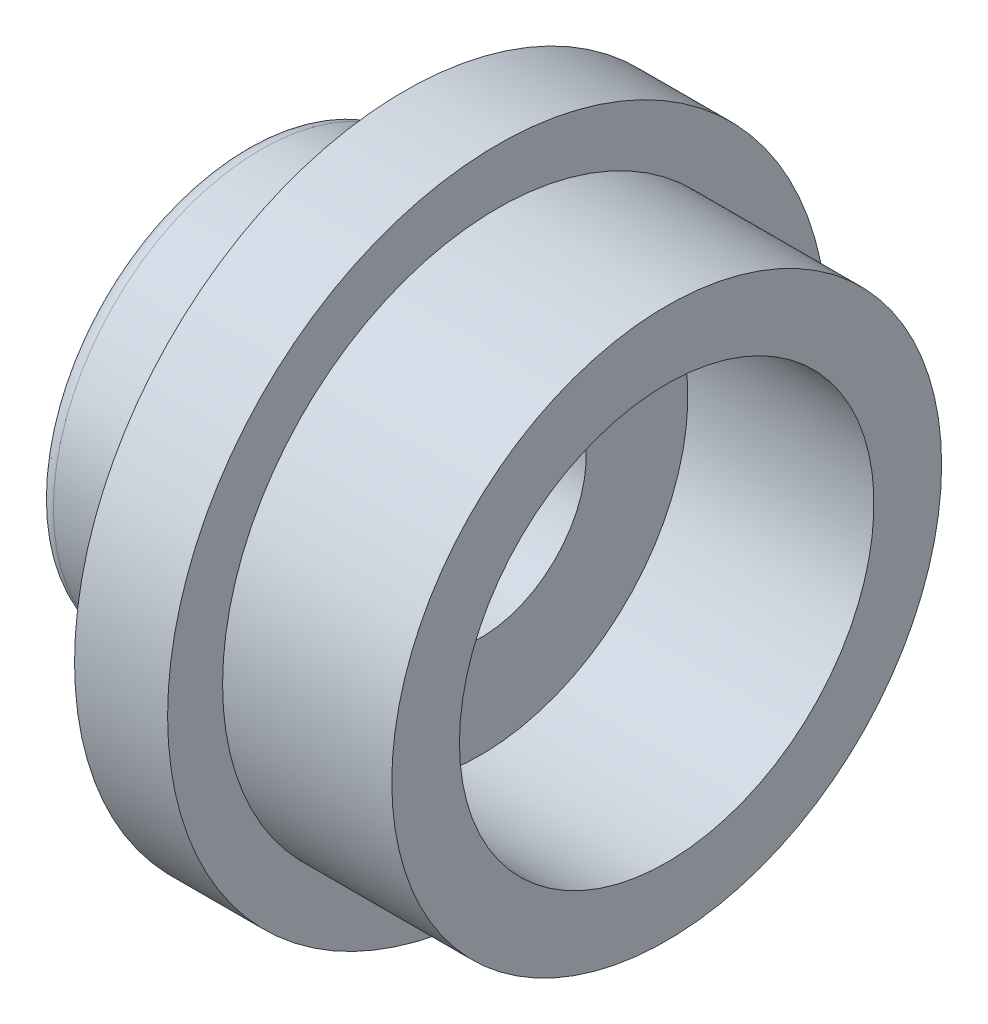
ISO-10303-21;
HEADER;
FILE_DESCRIPTION(('STEP AP214'),'2;1');
FILE_NAME('part.step','',(''),(''),'','','');
FILE_SCHEMA(('AUTOMOTIVE_DESIGN { 1 0 10303 214 1 1 1 1 }'));
ENDSEC;
DATA;
#1=APPLICATION_CONTEXT('core data for automotive mechanical design processes');
#2=APPLICATION_PROTOCOL_DEFINITION('international standard','automotive_design',2000,#1);
#3=PRODUCT_CONTEXT('',#1,'mechanical');
#4=PRODUCT('Part','Part','',(#3));
#5=PRODUCT_RELATED_PRODUCT_CATEGORY('part','',(#4));
#6=PRODUCT_DEFINITION_FORMATION('','',#4);
#7=PRODUCT_DEFINITION_CONTEXT('part definition',#1,'design');
#8=PRODUCT_DEFINITION('design','',#6,#7);
#9=PRODUCT_DEFINITION_SHAPE('','',#8);
#10=(LENGTH_UNIT() NAMED_UNIT(*) SI_UNIT(.MILLI.,.METRE.));
#11=(NAMED_UNIT(*) PLANE_ANGLE_UNIT() SI_UNIT($,.RADIAN.));
#12=(NAMED_UNIT(*) SI_UNIT($,.STERADIAN.) SOLID_ANGLE_UNIT());
#13=UNCERTAINTY_MEASURE_WITH_UNIT(LENGTH_MEASURE(1.E-05),#10,'distance_accuracy_value','');
#14=(GEOMETRIC_REPRESENTATION_CONTEXT(3) GLOBAL_UNCERTAINTY_ASSIGNED_CONTEXT((#13)) GLOBAL_UNIT_ASSIGNED_CONTEXT((#10,
#11,#12)) REPRESENTATION_CONTEXT('',''));
#15=CARTESIAN_POINT('',(0.,0.,0.));
#16=DIRECTION('',(0.,0.,1.));
#17=DIRECTION('',(1.,0.,0.));
#18=AXIS2_PLACEMENT_3D('',#15,#16,#17);
#19=CARTESIAN_POINT('',(0.,0.,0.));
#20=DIRECTION('',(-1.,0.,0.));
#21=DIRECTION('',(0.,0.,1.));
#22=AXIS2_PLACEMENT_3D('',#19,#20,#21);
#23=CYLINDRICAL_SURFACE('',#22,3.25);
#24=CARTESIAN_POINT('',(3.,0.,0.));
#25=DIRECTION('',(-1.,0.,0.));
#26=DIRECTION('',(0.,0.,1.));
#27=AXIS2_PLACEMENT_3D('',#24,#25,#26);
#28=CIRCLE('',#27,3.25);
#29=CARTESIAN_POINT('',(3.,0.,3.25));
#30=VERTEX_POINT('',#29);
#31=EDGE_CURVE('E34',#30,#30,#28,.T.);
#32=ORIENTED_EDGE('',*,*,#31,.F.);
#33=EDGE_LOOP('',(#32));
#34=FACE_BOUND('',#33,.T.);
#35=CARTESIAN_POINT('',(5.,0.,0.));
#36=DIRECTION('',(-1.,0.,0.));
#37=DIRECTION('',(0.,0.,1.));
#38=AXIS2_PLACEMENT_3D('',#35,#36,#37);
#39=CIRCLE('',#38,3.25);
#40=CARTESIAN_POINT('',(5.,0.,3.25));
#41=VERTEX_POINT('',#40);
#42=EDGE_CURVE('E61',#41,#41,#39,.T.);
#43=ORIENTED_EDGE('',*,*,#42,.T.);
#44=EDGE_LOOP('',(#43));
#45=FACE_BOUND('',#44,.T.);
#46=ADVANCED_FACE('F24',(#34,#45),#23,.T.);
#47=CARTESIAN_POINT('',(3.,3.25,0.));
#48=DIRECTION('',(-1.,0.,0.));
#49=DIRECTION('',(0.,0.,1.));
#50=AXIS2_PLACEMENT_3D('',#47,#48,#49);
#51=PLANE('',#50);
#52=CARTESIAN_POINT('',(3.,0.,0.));
#53=DIRECTION('',(-1.,0.,0.));
#54=DIRECTION('',(0.,0.,1.));
#55=AXIS2_PLACEMENT_3D('',#52,#53,#54);
#56=CIRCLE('',#55,3.9);
#57=CARTESIAN_POINT('',(3.,0.,3.9));
#58=VERTEX_POINT('',#57);
#59=EDGE_CURVE('E38',#58,#58,#56,.T.);
#60=ORIENTED_EDGE('',*,*,#59,.F.);
#61=EDGE_LOOP('',(#60));
#62=FACE_BOUND('',#61,.T.);
#63=ORIENTED_EDGE('',*,*,#31,.T.);
#64=EDGE_LOOP('',(#63));
#65=FACE_BOUND('',#64,.T.);
#66=ADVANCED_FACE('F102',(#62,#65),#51,.F.);
#67=CARTESIAN_POINT('',(0.,0.,0.));
#68=DIRECTION('',(-1.,0.,0.));
#69=DIRECTION('',(0.,0.,1.));
#70=AXIS2_PLACEMENT_3D('',#67,#68,#69);
#71=CYLINDRICAL_SURFACE('',#70,3.9);
#72=CARTESIAN_POINT('',(1.9,0.,0.));
#73=DIRECTION('',(-1.,0.,0.));
#74=DIRECTION('',(0.,0.,1.));
#75=AXIS2_PLACEMENT_3D('',#72,#73,#74);
#76=CIRCLE('',#75,3.9);
#77=CARTESIAN_POINT('',(1.9,0.,3.9));
#78=VERTEX_POINT('',#77);
#79=EDGE_CURVE('E43',#78,#78,#76,.T.);
#80=ORIENTED_EDGE('',*,*,#79,.F.);
#81=EDGE_LOOP('',(#80));
#82=FACE_BOUND('',#81,.T.);
#83=ORIENTED_EDGE('',*,*,#59,.T.);
#84=EDGE_LOOP('',(#83));
#85=FACE_BOUND('',#84,.T.);
#86=ADVANCED_FACE('F107',(#82,#85),#71,.T.);
#87=CARTESIAN_POINT('',(1.9,3.9,0.));
#88=DIRECTION('',(1.,0.,0.));
#89=DIRECTION('',(0.,0.,-1.));
#90=AXIS2_PLACEMENT_3D('',#87,#88,#89);
#91=PLANE('',#90);
#92=CARTESIAN_POINT('',(1.9,0.,0.));
#93=DIRECTION('',(-1.,0.,0.));
#94=DIRECTION('',(0.,0.,1.));
#95=AXIS2_PLACEMENT_3D('',#92,#93,#94);
#96=CIRCLE('',#95,2.45);
#97=CARTESIAN_POINT('',(1.9,0.,2.45));
#98=VERTEX_POINT('',#97);
#99=EDGE_CURVE('E46',#98,#98,#96,.T.);
#100=ORIENTED_EDGE('',*,*,#99,.F.);
#101=EDGE_LOOP('',(#100));
#102=FACE_BOUND('',#101,.T.);
#103=ORIENTED_EDGE('',*,*,#79,.T.);
#104=EDGE_LOOP('',(#103));
#105=FACE_BOUND('',#104,.T.);
#106=ADVANCED_FACE('F114',(#102,#105),#91,.F.);
#107=CARTESIAN_POINT('',(0.,0.,0.));
#108=DIRECTION('',(-1.,0.,0.));
#109=DIRECTION('',(0.,0.,1.));
#110=AXIS2_PLACEMENT_3D('',#107,#108,#109);
#111=CYLINDRICAL_SURFACE('',#110,2.45);
#112=CARTESIAN_POINT('',(0.200000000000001,0.,0.));
#113=DIRECTION('',(1.,0.,0.));
#114=DIRECTION('',(0.,0.,-1.));
#115=AXIS2_PLACEMENT_3D('',#112,#113,#114);
#116=CIRCLE('',#115,2.45);
#117=CARTESIAN_POINT('',(0.200000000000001,0.,-2.45));
#118=VERTEX_POINT('',#117);
#119=EDGE_CURVE('E10',#118,#118,#116,.T.);
#120=ORIENTED_EDGE('',*,*,#119,.T.);
#121=EDGE_LOOP('',(#120));
#122=FACE_BOUND('',#121,.T.);
#123=ORIENTED_EDGE('',*,*,#99,.T.);
#124=EDGE_LOOP('',(#123));
#125=FACE_BOUND('',#124,.T.);
#126=ADVANCED_FACE('F99',(#122,#125),#111,.T.);
#127=CARTESIAN_POINT('',(0.,2.45,0.));
#128=DIRECTION('',(1.,0.,0.));
#129=DIRECTION('',(0.,0.,-1.));
#130=AXIS2_PLACEMENT_3D('',#127,#128,#129);
#131=PLANE('',#130);
#132=CARTESIAN_POINT('',(0.,0.,0.));
#133=DIRECTION('',(1.,0.,0.));
#134=DIRECTION('',(0.,0.,-1.));
#135=AXIS2_PLACEMENT_3D('',#132,#133,#134);
#136=CIRCLE('',#135,2.25);
#137=CARTESIAN_POINT('',(0.,0.,-2.25));
#138=VERTEX_POINT('',#137);
#139=EDGE_CURVE('E30',#138,#138,#136,.F.);
#140=ORIENTED_EDGE('',*,*,#139,.T.);
#141=EDGE_LOOP('',(#140));
#142=FACE_BOUND('',#141,.T.);
#143=ADVANCED_FACE('F93',(#142),#131,.F.);
#144=CARTESIAN_POINT('',(1.2,1.25,0.));
#145=DIRECTION('',(-1.,0.,0.));
#146=DIRECTION('',(0.,0.,1.));
#147=AXIS2_PLACEMENT_3D('',#144,#145,#146);
#148=PLANE('',#147);
#149=CARTESIAN_POINT('',(1.2,0.,0.));
#150=DIRECTION('',(-1.,0.,0.));
#151=DIRECTION('',(0.,0.,1.));
#152=AXIS2_PLACEMENT_3D('',#149,#150,#151);
#153=CIRCLE('',#152,1.25);
#154=CARTESIAN_POINT('',(1.2,0.,1.25));
#155=VERTEX_POINT('',#154);
#156=EDGE_CURVE('E49',#155,#155,#153,.T.);
#157=ORIENTED_EDGE('',*,*,#156,.F.);
#158=EDGE_LOOP('',(#157));
#159=FACE_BOUND('',#158,.T.);
#160=ADVANCED_FACE('F88',(#159),#148,.F.);
#161=CARTESIAN_POINT('',(0.,0.,0.));
#162=DIRECTION('',(-1.,0.,0.));
#163=DIRECTION('',(0.,0.,1.));
#164=AXIS2_PLACEMENT_3D('',#161,#162,#163);
#165=CYLINDRICAL_SURFACE('',#164,1.25);
#166=CARTESIAN_POINT('',(2.8,0.,0.));
#167=DIRECTION('',(-1.,0.,0.));
#168=DIRECTION('',(0.,0.,1.));
#169=AXIS2_PLACEMENT_3D('',#166,#167,#168);
#170=CIRCLE('',#169,1.25);
#171=CARTESIAN_POINT('',(2.8,0.,1.25));
#172=VERTEX_POINT('',#171);
#173=EDGE_CURVE('E52',#172,#172,#170,.T.);
#174=ORIENTED_EDGE('',*,*,#173,.F.);
#175=EDGE_LOOP('',(#174));
#176=FACE_BOUND('',#175,.T.);
#177=ORIENTED_EDGE('',*,*,#156,.T.);
#178=EDGE_LOOP('',(#177));
#179=FACE_BOUND('',#178,.T.);
#180=ADVANCED_FACE('F82',(#176,#179),#165,.F.);
#181=CARTESIAN_POINT('',(2.8,2.45,0.));
#182=DIRECTION('',(-1.,0.,0.));
#183=DIRECTION('',(0.,0.,1.));
#184=AXIS2_PLACEMENT_3D('',#181,#182,#183);
#185=PLANE('',#184);
#186=CARTESIAN_POINT('',(2.8,0.,0.));
#187=DIRECTION('',(-1.,0.,0.));
#188=DIRECTION('',(0.,0.,1.));
#189=AXIS2_PLACEMENT_3D('',#186,#187,#188);
#190=CIRCLE('',#189,2.45);
#191=CARTESIAN_POINT('',(2.8,0.,2.45));
#192=VERTEX_POINT('',#191);
#193=EDGE_CURVE('E55',#192,#192,#190,.T.);
#194=ORIENTED_EDGE('',*,*,#193,.F.);
#195=EDGE_LOOP('',(#194));
#196=FACE_BOUND('',#195,.T.);
#197=ORIENTED_EDGE('',*,*,#173,.T.);
#198=EDGE_LOOP('',(#197));
#199=FACE_BOUND('',#198,.T.);
#200=ADVANCED_FACE('F76',(#196,#199),#185,.F.);
#201=CARTESIAN_POINT('',(0.,0.,0.));
#202=DIRECTION('',(-1.,0.,0.));
#203=DIRECTION('',(0.,0.,1.));
#204=AXIS2_PLACEMENT_3D('',#201,#202,#203);
#205=CYLINDRICAL_SURFACE('',#204,2.45);
#206=CARTESIAN_POINT('',(5.,0.,0.));
#207=DIRECTION('',(-1.,0.,0.));
#208=DIRECTION('',(0.,0.,1.));
#209=AXIS2_PLACEMENT_3D('',#206,#207,#208);
#210=CIRCLE('',#209,2.45);
#211=CARTESIAN_POINT('',(5.,0.,2.45));
#212=VERTEX_POINT('',#211);
#213=EDGE_CURVE('E58',#212,#212,#210,.T.);
#214=ORIENTED_EDGE('',*,*,#213,.F.);
#215=EDGE_LOOP('',(#214));
#216=FACE_BOUND('',#215,.T.);
#217=ORIENTED_EDGE('',*,*,#193,.T.);
#218=EDGE_LOOP('',(#217));
#219=FACE_BOUND('',#218,.T.);
#220=ADVANCED_FACE('F70',(#216,#219),#205,.F.);
#221=CARTESIAN_POINT('',(5.,3.25,0.));
#222=DIRECTION('',(-1.,0.,0.));
#223=DIRECTION('',(0.,0.,1.));
#224=AXIS2_PLACEMENT_3D('',#221,#222,#223);
#225=PLANE('',#224);
#226=ORIENTED_EDGE('',*,*,#42,.F.);
#227=EDGE_LOOP('',(#226));
#228=FACE_BOUND('',#227,.T.);
#229=ORIENTED_EDGE('',*,*,#213,.T.);
#230=EDGE_LOOP('',(#229));
#231=FACE_BOUND('',#230,.T.);
#232=ADVANCED_FACE('F66',(#228,#231),#225,.F.);
#233=CARTESIAN_POINT('',(0.200000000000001,0.,0.));
#234=DIRECTION('',(1.,0.,0.));
#235=DIRECTION('',(0.,0.,-1.));
#236=AXIS2_PLACEMENT_3D('',#233,#234,#235);
#237=TOROIDAL_SURFACE('',#236,2.25,0.2);
#238=ORIENTED_EDGE('',*,*,#119,.F.);
#239=EDGE_LOOP('',(#238));
#240=FACE_BOUND('',#239,.T.);
#241=ORIENTED_EDGE('',*,*,#139,.F.);
#242=EDGE_LOOP('',(#241));
#243=FACE_BOUND('',#242,.T.);
#244=ADVANCED_FACE('F69',(#240,#243),#237,.T.);
#245=CLOSED_SHELL('',(#46,#66,#86,#106,#126,#143,#160,#180,#200,#220,#232,#244));
#246=MANIFOLD_SOLID_BREP('B2',#245);
#247=ADVANCED_BREP_SHAPE_REPRESENTATION('',(#18,#246),#14);
#248=SHAPE_DEFINITION_REPRESENTATION(#9,#247);
ENDSEC;
END-ISO-10303-21;
